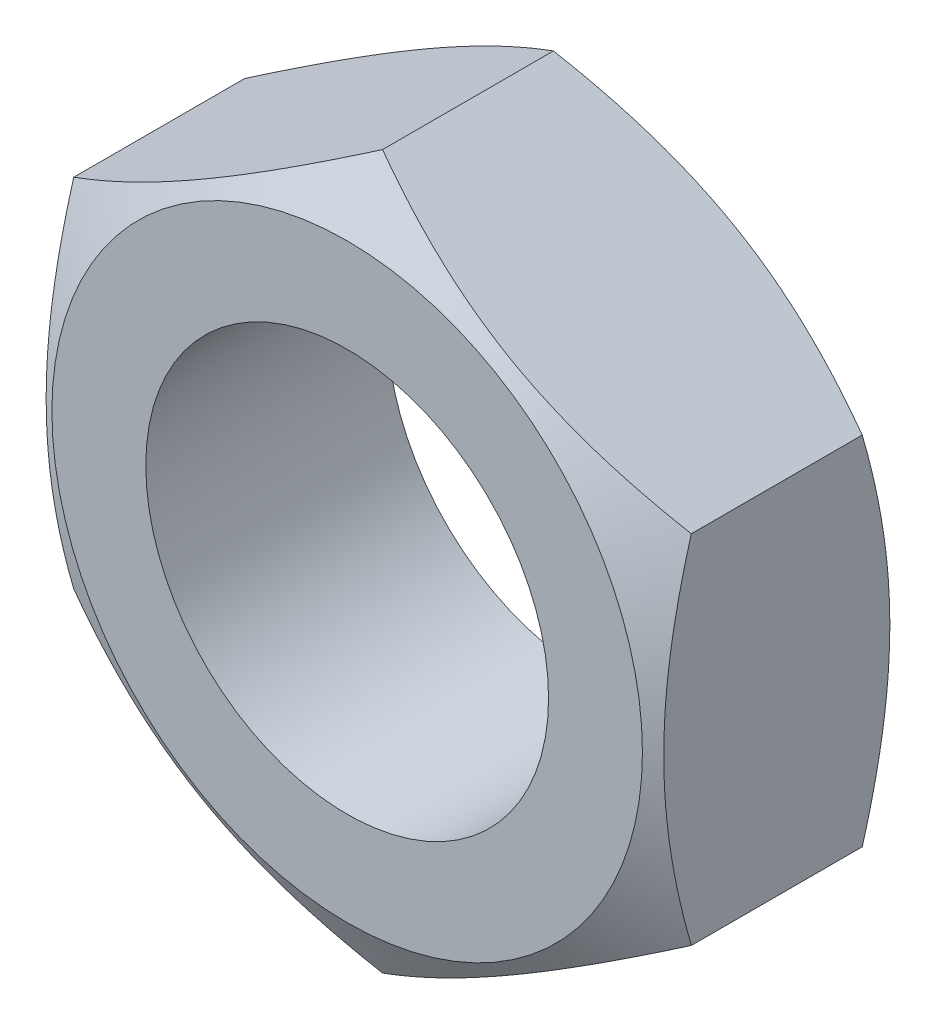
ISO-10303-21;
HEADER;
FILE_DESCRIPTION(('STEP AP214'),'2;1');
FILE_NAME('part.step','',(''),(''),'','','');
FILE_SCHEMA(('AUTOMOTIVE_DESIGN { 1 0 10303 214 1 1 1 1 }'));
ENDSEC;
DATA;
#1=APPLICATION_CONTEXT('core data for automotive mechanical design processes');
#2=APPLICATION_PROTOCOL_DEFINITION('international standard','automotive_design',2000,#1);
#3=PRODUCT_CONTEXT('',#1,'mechanical');
#4=PRODUCT('Part','Part','',(#3));
#5=PRODUCT_RELATED_PRODUCT_CATEGORY('part','',(#4));
#6=PRODUCT_DEFINITION_FORMATION('','',#4);
#7=PRODUCT_DEFINITION_CONTEXT('part definition',#1,'design');
#8=PRODUCT_DEFINITION('design','',#6,#7);
#9=PRODUCT_DEFINITION_SHAPE('','',#8);
#10=(LENGTH_UNIT() NAMED_UNIT(*) SI_UNIT(.MILLI.,.METRE.));
#11=(NAMED_UNIT(*) PLANE_ANGLE_UNIT() SI_UNIT($,.RADIAN.));
#12=(NAMED_UNIT(*) SI_UNIT($,.STERADIAN.) SOLID_ANGLE_UNIT());
#13=UNCERTAINTY_MEASURE_WITH_UNIT(LENGTH_MEASURE(1.E-05),#10,'distance_accuracy_value','');
#14=(GEOMETRIC_REPRESENTATION_CONTEXT(3) GLOBAL_UNCERTAINTY_ASSIGNED_CONTEXT((#13)) GLOBAL_UNIT_ASSIGNED_CONTEXT((#10,
#11,#12)) REPRESENTATION_CONTEXT('',''));
#15=CARTESIAN_POINT('',(0.,0.,0.));
#16=DIRECTION('',(0.,0.,1.));
#17=DIRECTION('',(1.,0.,0.));
#18=AXIS2_PLACEMENT_3D('',#15,#16,#17);
#19=CARTESIAN_POINT('',(0.,0.,0.));
#20=DIRECTION('',(0.,0.,1.));
#21=DIRECTION('',(0.,-1.,0.));
#22=AXIS2_PLACEMENT_3D('',#19,#20,#21);
#23=CONICAL_SURFACE('',#22,21.9924229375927,1.0471975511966);
#24=CARTESIAN_POINT('',(0.,0.,0.));
#25=DIRECTION('',(0.,0.,1.));
#26=DIRECTION('',(0.,-1.,0.));
#27=AXIS2_PLACEMENT_3D('',#24,#25,#26);
#28=CIRCLE('',#27,21.9924229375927);
#29=CARTESIAN_POINT('',(0.,-21.9924229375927,0.));
#30=VERTEX_POINT('',#29);
#31=EDGE_CURVE('E18',#30,#30,#28,.T.);
#32=ORIENTED_EDGE('',*,*,#31,.T.);
#33=EDGE_LOOP('',(#32));
#34=FACE_BOUND('',#33,.T.);
#35=CARTESIAN_POINT('',(-23.0001999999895,-13.2789407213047,2.63606869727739));
#36=CARTESIAN_POINT('',(-22.4946699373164,-13.5708086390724,2.46757088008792));
#37=CARTESIAN_POINT('',(-21.9871680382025,-13.86381499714,2.30671927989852));
#38=CARTESIAN_POINT('',(-20.968094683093,-14.4521772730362,2.00243388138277));
#39=CARTESIAN_POINT('',(-20.4565219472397,-14.7475339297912,1.859005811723));
#40=CARTESIAN_POINT('',(-19.4283073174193,-15.3411739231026,1.59149261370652));
#41=CARTESIAN_POINT('',(-18.9116563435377,-15.6394625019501,1.46745367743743));
#42=CARTESIAN_POINT('',(-17.8747863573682,-16.2380996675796,1.24139083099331));
#43=CARTESIAN_POINT('',(-17.354567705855,-16.5384480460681,1.13936472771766));
#44=CARTESIAN_POINT('',(-16.3238595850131,-17.133527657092,0.961658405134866));
#45=CARTESIAN_POINT('',(-15.8134465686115,-17.4282147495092,0.885390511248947));
#46=CARTESIAN_POINT('',(-14.7902817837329,-18.0189392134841,0.757506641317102));
#47=CARTESIAN_POINT('',(-14.2775299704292,-18.3149766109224,0.705891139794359));
#48=CARTESIAN_POINT('',(-13.2511650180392,-18.9075486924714,0.628615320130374));
#49=CARTESIAN_POINT('',(-12.7375536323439,-19.2040823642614,0.602924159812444));
#50=CARTESIAN_POINT('',(-11.7098568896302,-19.7974233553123,0.578049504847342));
#51=CARTESIAN_POINT('',(-11.1957715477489,-20.0942306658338,0.578865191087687));
#52=CARTESIAN_POINT('',(-10.2346805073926,-20.6491168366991,0.605152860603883));
#53=CARTESIAN_POINT('',(-9.78760635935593,-20.9072352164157,0.627419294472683));
#54=CARTESIAN_POINT('',(-8.89452539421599,-21.4228557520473,0.691576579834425));
#55=CARTESIAN_POINT('',(-8.4485185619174,-21.6803579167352,0.733467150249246));
#56=CARTESIAN_POINT('',(-7.55773701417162,-22.1946508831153,0.836146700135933));
#57=CARTESIAN_POINT('',(-7.11296378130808,-22.4514408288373,0.896952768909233));
#58=CARTESIAN_POINT('',(-6.22554696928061,-22.9637911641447,1.0363871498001));
#59=CARTESIAN_POINT('',(-5.78290338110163,-23.2193515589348,1.11501538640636));
#60=CARTESIAN_POINT('',(-4.43913170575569,-23.995178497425,1.37965122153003));
#61=CARTESIAN_POINT('',(-3.54182151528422,-24.5132407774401,1.59206038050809));
#62=CARTESIAN_POINT('',(-2.20576568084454,-25.2846129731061,1.95367700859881));
#63=CARTESIAN_POINT('',(-1.7624481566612,-25.5405624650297,2.08125290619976));
#64=CARTESIAN_POINT('',(-0.878879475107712,-26.050691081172,2.3493201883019));
#65=CARTESIAN_POINT('',(-0.438627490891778,-26.3048706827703,2.48980793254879));
#66=CARTESIAN_POINT('',(0.000200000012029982,-26.5582278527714,2.63606869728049));
#67=B_SPLINE_CURVE_WITH_KNOTS('',3,(#35,#36,#37,#38,#39,#40,#41,#42,#43,#44,#45,#46,#47,#48,#49,
#50,#51,#52,#53,#54,#55,#56,#57,#58,#59,#60,#61,#62,#63,#64,#65,#66),.UNSPECIFIED.,.F.,.F.,(4,2,
2,2,2,2,2,2,2,2,2,2,2,2,2,4),(0.,1.82275209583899,3.64610187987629,5.47373144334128,
7.30117883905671,9.08355891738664,10.8659733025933,12.6462646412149,14.4265009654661,
15.9762768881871,17.5260306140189,19.0771885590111,20.6283399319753,23.7989683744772,
25.3815208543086,26.9636285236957),.UNSPECIFIED.);
#68=CARTESIAN_POINT('',(-22.9999999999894,-13.2790561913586,2.63600203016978));
#69=VERTEX_POINT('',#68);
#70=CARTESIAN_POINT('',(1.20320420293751E-11,-26.5581123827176,2.63600203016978));
#71=VERTEX_POINT('',#70);
#72=EDGE_CURVE('E208',#69,#71,#67,.T.);
#73=ORIENTED_EDGE('',*,*,#72,.F.);
#74=CARTESIAN_POINT('',(-22.999999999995,35.137391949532,11.5488801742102));
#75=CARTESIAN_POINT('',(-22.9999999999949,34.6328085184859,11.3051417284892));
#76=CARTESIAN_POINT('',(-22.9999999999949,34.1276124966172,11.0626675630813));
#77=CARTESIAN_POINT('',(-22.9999999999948,33.1158666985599,10.5805463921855));
#78=CARTESIAN_POINT('',(-22.9999999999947,32.6093169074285,10.3408994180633));
#79=CARTESIAN_POINT('',(-22.9999999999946,31.5946593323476,9.86469588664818));
#80=CARTESIAN_POINT('',(-22.9999999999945,31.0865512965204,9.6281398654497));
#81=CARTESIAN_POINT('',(-22.9999999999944,30.0687263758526,9.15852083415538));
#82=CARTESIAN_POINT('',(-22.9999999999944,29.559009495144,8.92545781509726));
#83=CARTESIAN_POINT('',(-22.9999999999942,28.0213285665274,8.22942578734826));
#84=CARTESIAN_POINT('',(-22.9999999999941,26.990675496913,7.7723659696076));
#85=CARTESIAN_POINT('',(-22.9999999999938,24.920876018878,6.87798435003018));
#86=CARTESIAN_POINT('',(-22.9999999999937,23.8817300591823,6.44066151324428));
#87=CARTESIAN_POINT('',(-22.9999999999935,21.7807603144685,5.58598416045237));
#88=CARTESIAN_POINT('',(-22.9999999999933,20.7188138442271,5.16892959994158));
#89=CARTESIAN_POINT('',(-22.9999999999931,18.5823596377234,4.36768430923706));
#90=CARTESIAN_POINT('',(-22.999999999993,17.5078505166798,3.98349724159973));
#91=CARTESIAN_POINT('',(-22.9999999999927,15.3468305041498,3.25837418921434));
#92=CARTESIAN_POINT('',(-22.9999999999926,14.2603509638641,2.91734554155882));
#93=CARTESIAN_POINT('',(-22.9999999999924,12.0718448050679,2.28965048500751));
#94=CARTESIAN_POINT('',(-22.9999999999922,10.9698232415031,2.00296681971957));
#95=CARTESIAN_POINT('',(-22.999999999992,9.30491916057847,1.62423003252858));
#96=CARTESIAN_POINT('',(-22.999999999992,8.74783648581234,1.50651031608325));
#97=CARTESIAN_POINT('',(-22.9999999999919,7.62997982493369,1.29003650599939));
#98=CARTESIAN_POINT('',(-22.9999999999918,7.06920592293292,1.19128198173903));
#99=CARTESIAN_POINT('',(-22.9999999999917,5.94434909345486,1.01449389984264));
#100=CARTESIAN_POINT('',(-22.9999999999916,5.3802659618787,0.936461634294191));
#101=CARTESIAN_POINT('',(-22.9999999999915,4.24944349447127,0.802688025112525));
#102=CARTESIAN_POINT('',(-22.9999999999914,3.68270415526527,0.746946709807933));
#103=CARTESIAN_POINT('',(-22.9999999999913,2.55094652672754,0.659251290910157));
#104=CARTESIAN_POINT('',(-22.9999999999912,1.98593968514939,0.627150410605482));
#105=CARTESIAN_POINT('',(-22.9999999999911,0.855076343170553,0.586903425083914));
#106=CARTESIAN_POINT('',(-22.999999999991,0.28921985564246,0.578756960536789));
#107=CARTESIAN_POINT('',(-22.9999999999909,-0.842172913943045,0.586611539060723));
#108=CARTESIAN_POINT('',(-22.9999999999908,-1.40770924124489,0.602605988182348));
#109=CARTESIAN_POINT('',(-22.9999999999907,-2.5376141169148,0.658347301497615));
#110=CARTESIAN_POINT('',(-22.9999999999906,-3.10198261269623,0.69809521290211));
#111=CARTESIAN_POINT('',(-22.9999999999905,-4.47201591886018,0.822591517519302));
#112=CARTESIAN_POINT('',(-22.9999999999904,-5.27660599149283,0.919361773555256));
#113=CARTESIAN_POINT('',(-22.9999999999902,-6.87947044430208,1.15577839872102));
#114=CARTESIAN_POINT('',(-22.9999999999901,-7.67774385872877,1.29543119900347));
#115=CARTESIAN_POINT('',(-22.9999999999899,-9.26839888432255,1.61286098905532));
#116=CARTESIAN_POINT('',(-22.9999999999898,-10.0607640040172,1.7907198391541));
#117=CARTESIAN_POINT('',(-22.9999999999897,-11.6373562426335,2.17904286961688));
#118=CARTESIAN_POINT('',(-22.9999999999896,-12.4215836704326,2.38950580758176));
#119=CARTESIAN_POINT('',(-22.9999999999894,-14.0002566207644,2.84323429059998));
#120=CARTESIAN_POINT('',(-22.9999999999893,-14.7945138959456,3.08715038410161));
#121=CARTESIAN_POINT('',(-22.9999999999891,-16.3752474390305,3.5990952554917));
#122=CARTESIAN_POINT('',(-22.999999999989,-17.1617230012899,3.86712619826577));
#123=CARTESIAN_POINT('',(-22.9999999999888,-18.7231078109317,4.42164466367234));
#124=CARTESIAN_POINT('',(-22.9999999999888,-19.4980573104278,4.70801928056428));
#125=CARTESIAN_POINT('',(-22.9999999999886,-20.6556047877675,5.14989443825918));
#126=CARTESIAN_POINT('',(-22.9999999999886,-21.0405800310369,5.29921352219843));
#127=CARTESIAN_POINT('',(-22.9999999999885,-21.8090350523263,5.60162181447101));
#128=CARTESIAN_POINT('',(-22.9999999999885,-22.1925148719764,5.75471091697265));
#129=CARTESIAN_POINT('',(-22.9999999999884,-22.5753017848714,5.90951556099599));
#130=B_SPLINE_CURVE_WITH_KNOTS('',3,(#74,#75,#76,#77,#78,#79,#80,#81,#82,#83,#84,#85,#86,#87,
#88,#89,#90,#91,#92,#93,#94,#95,#96,#97,#98,#99,#100,#101,#102,#103,#104,#105,#106,#107,#108,
#109,#110,#111,#112,#113,#114,#115,#116,#117,#118,#119,#120,#121,#122,#123,#124,#125,#126,#127,
#128,#129),.UNSPECIFIED.,.F.,.F.,(4,2,2,2,2,2,2,2,2,2,2,2,2,2,2,2,2,2,2,2,2,2,2,2,2,2,2,4),(0.,
1.68110615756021,3.36223094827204,5.04364354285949,6.72505182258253,10.1072380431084,
13.4892467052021,16.911546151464,20.3342264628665,23.7494287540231,27.1635447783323,
28.8714282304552,30.5792728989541,32.28722403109,33.9951773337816,35.6924349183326,
37.3896670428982,39.08643566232,40.7832790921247,43.213090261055,45.6432660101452,
48.0787015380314,50.5140442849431,53.0061841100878,55.4985478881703,57.9768217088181,
59.2155628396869,60.4542692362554),.UNSPECIFIED.);
#131=CARTESIAN_POINT('',(-22.9999999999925,13.2790561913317,2.63600203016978));
#132=VERTEX_POINT('',#131);
#133=EDGE_CURVE('E90',#132,#69,#130,.T.);
#134=ORIENTED_EDGE('',*,*,#133,.F.);
#135=CARTESIAN_POINT('',(0.000199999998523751,26.5582278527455,2.63606869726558));
#136=CARTESIAN_POINT('',(-0.505330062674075,26.266359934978,2.4675708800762));
#137=CARTESIAN_POINT('',(-1.01283196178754,25.9733535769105,2.30671927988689));
#138=CARTESIAN_POINT('',(-2.03190531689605,25.3849913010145,2.00243388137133));
#139=CARTESIAN_POINT('',(-2.54347805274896,25.0896346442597,1.85900581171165));
#140=CARTESIAN_POINT('',(-3.57169268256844,24.4959946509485,1.59149261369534));
#141=CARTESIAN_POINT('',(-4.08834365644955,24.1977060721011,1.46745367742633));
#142=CARTESIAN_POINT('',(-5.12521364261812,23.5990689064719,1.24139083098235));
#143=CARTESIAN_POINT('',(-5.64543229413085,23.2987205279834,1.13936472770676));
#144=CARTESIAN_POINT('',(-6.67614041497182,22.7036409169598,0.961658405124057));
#145=CARTESIAN_POINT('',(-7.18655343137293,22.4089538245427,0.885390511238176));
#146=CARTESIAN_POINT('',(-8.20971821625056,21.8182293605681,0.75750664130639));
#147=CARTESIAN_POINT('',(-8.72247002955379,21.5221919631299,0.705891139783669));
#148=CARTESIAN_POINT('',(-9.74883498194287,20.9296198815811,0.628615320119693));
#149=CARTESIAN_POINT('',(-10.2624463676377,20.6330862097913,0.602924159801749));
#150=CARTESIAN_POINT('',(-11.2901431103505,20.0397452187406,0.578049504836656));
#151=CARTESIAN_POINT('',(-11.8042284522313,19.7429379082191,0.578865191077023));
#152=CARTESIAN_POINT('',(-12.7653194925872,19.1880517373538,0.605152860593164));
#153=CARTESIAN_POINT('',(-13.2123936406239,18.929933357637,0.627419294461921));
#154=CARTESIAN_POINT('',(-14.1054746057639,18.4143128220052,0.691576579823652));
#155=CARTESIAN_POINT('',(-14.5514814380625,18.1568106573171,0.733467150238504));
#156=CARTESIAN_POINT('',(-15.4422629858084,17.6425176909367,0.836146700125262));
#157=CARTESIAN_POINT('',(-15.8870362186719,17.3857277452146,0.896952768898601));
#158=CARTESIAN_POINT('',(-16.7744530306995,16.8733774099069,1.03638714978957));
#159=CARTESIAN_POINT('',(-17.2170966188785,16.6178170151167,1.11501538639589));
#160=CARTESIAN_POINT('',(-18.5608682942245,15.841990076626,1.37965122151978));
#161=CARTESIAN_POINT('',(-19.458178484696,15.3239277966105,1.59206038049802));
#162=CARTESIAN_POINT('',(-20.7942343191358,14.5525556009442,1.95367700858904));
#163=CARTESIAN_POINT('',(-21.2375518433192,14.2966061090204,2.08125290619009));
#164=CARTESIAN_POINT('',(-22.1211205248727,13.7864774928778,2.34932018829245));
#165=CARTESIAN_POINT('',(-22.5613725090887,13.5322978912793,2.48980793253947));
#166=CARTESIAN_POINT('',(-23.0001999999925,13.2789407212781,2.63606869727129));
#167=B_SPLINE_CURVE_WITH_KNOTS('',3,(#135,#136,#137,#138,#139,#140,#141,#142,#143,#144,#145,
#146,#147,#148,#149,#150,#151,#152,#153,#154,#155,#156,#157,#158,#159,#160,#161,#162,#163,#164,
#165,#166),.UNSPECIFIED.,.F.,.F.,(4,2,2,2,2,2,2,2,2,2,2,2,2,2,2,4),(0.,1.82275209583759,
3.64610187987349,5.47373144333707,7.30117883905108,9.08355891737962,10.8659733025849,
12.6462646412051,14.4265009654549,15.9762768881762,17.5260306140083,19.0771885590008,
20.6283399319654,23.798968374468,25.3815208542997,26.9636285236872),.UNSPECIFIED.);
#168=CARTESIAN_POINT('',(-1.47624967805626E-12,26.5581123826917,2.63600203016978));
#169=VERTEX_POINT('',#168);
#170=EDGE_CURVE('E82',#169,#132,#167,.T.);
#171=ORIENTED_EDGE('',*,*,#170,.F.);
#172=CARTESIAN_POINT('',(23.0001999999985,13.2789407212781,2.63606869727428));
#173=CARTESIAN_POINT('',(22.4946699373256,13.5708086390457,2.46757088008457));
#174=CARTESIAN_POINT('',(21.9871680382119,13.8638149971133,2.30671927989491));
#175=CARTESIAN_POINT('',(20.9680946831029,14.4521772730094,2.00243388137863));
#176=CARTESIAN_POINT('',(20.4565219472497,14.7475339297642,1.8590058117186));
#177=CARTESIAN_POINT('',(19.4283073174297,15.3411739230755,1.59149261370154));
#178=CARTESIAN_POINT('',(18.9116563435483,15.6394625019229,1.46745367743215));
#179=CARTESIAN_POINT('',(17.8747863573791,16.2380996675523,1.24139083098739));
#180=CARTESIAN_POINT('',(17.3545677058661,16.5384480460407,1.13936472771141));
#181=CARTESIAN_POINT('',(16.3238595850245,17.1335276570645,0.961658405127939));
#182=CARTESIAN_POINT('',(15.8134465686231,17.4282147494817,0.88539051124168));
#183=CARTESIAN_POINT('',(14.7902817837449,18.0189392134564,0.757506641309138));
#184=CARTESIAN_POINT('',(14.2775299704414,18.3149766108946,0.705891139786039));
#185=CARTESIAN_POINT('',(13.2511650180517,18.9075486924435,0.62861532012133));
#186=CARTESIAN_POINT('',(12.7375536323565,19.2040823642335,0.602924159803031));
#187=CARTESIAN_POINT('',(11.7098568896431,19.7974233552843,0.578049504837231));
#188=CARTESIAN_POINT('',(11.1957715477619,20.0942306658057,0.578865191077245));
#189=CARTESIAN_POINT('',(10.2346805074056,20.6491168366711,0.605152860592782));
#190=CARTESIAN_POINT('',(9.78760635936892,20.9072352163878,0.627419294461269));
#191=CARTESIAN_POINT('',(8.89452539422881,21.4228557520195,0.691576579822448));
#192=CARTESIAN_POINT('',(8.44851856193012,21.6803579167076,0.733467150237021));
#193=CARTESIAN_POINT('',(7.55773701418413,22.1946508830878,0.836146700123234));
#194=CARTESIAN_POINT('',(7.11296378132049,22.4514408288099,0.896952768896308));
#195=CARTESIAN_POINT('',(6.22554696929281,22.9637911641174,1.03638714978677));
#196=CARTESIAN_POINT('',(5.78290338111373,23.2193515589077,1.11501538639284));
#197=CARTESIAN_POINT('',(4.43913170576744,23.9951784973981,1.37965122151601));
#198=CARTESIAN_POINT('',(3.54182151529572,24.5132407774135,1.59206038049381));
#199=CARTESIAN_POINT('',(2.20576568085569,25.2846129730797,1.95367700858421));
#200=CARTESIAN_POINT('',(1.76244815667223,25.5405624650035,2.08125290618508));
#201=CARTESIAN_POINT('',(0.878879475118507,26.050691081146,2.34932018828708));
#202=CARTESIAN_POINT('',(0.438627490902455,26.3048706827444,2.48980793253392));
#203=CARTESIAN_POINT('',(-0.000200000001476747,26.5582278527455,2.63606869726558));
#204=B_SPLINE_CURVE_WITH_KNOTS('',3,(#172,#173,#174,#175,#176,#177,#178,#179,#180,#181,#182,
#183,#184,#185,#186,#187,#188,#189,#190,#191,#192,#193,#194,#195,#196,#197,#198,#199,#200,#201,
#202,#203),.UNSPECIFIED.,.F.,.F.,(4,2,2,2,2,2,2,2,2,2,2,2,2,2,2,4),(0.,1.8227520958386,
3.6461018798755,5.47373144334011,7.30117883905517,9.08355891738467,10.865973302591,
12.6462646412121,14.4265009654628,15.9762768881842,17.5260306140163,19.0771885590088,
20.6283399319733,23.798968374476,25.3815208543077,26.9636285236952),.UNSPECIFIED.);
#205=CARTESIAN_POINT('',(22.9999999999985,13.279056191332,2.63600203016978));
#206=VERTEX_POINT('',#205);
#207=EDGE_CURVE('E67',#206,#169,#204,.T.);
#208=ORIENTED_EDGE('',*,*,#207,.F.);
#209=CARTESIAN_POINT('',(22.999999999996,35.1373919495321,11.5488801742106));
#210=CARTESIAN_POINT('',(22.999999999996,34.6328085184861,11.3051417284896));
#211=CARTESIAN_POINT('',(22.9999999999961,34.1276124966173,11.0626675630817));
#212=CARTESIAN_POINT('',(22.9999999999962,33.1158666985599,10.580546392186));
#213=CARTESIAN_POINT('',(22.9999999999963,32.6093169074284,10.3408994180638));
#214=CARTESIAN_POINT('',(22.9999999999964,31.5946593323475,9.86469588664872));
#215=CARTESIAN_POINT('',(22.9999999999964,31.0865512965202,9.62813986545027));
#216=CARTESIAN_POINT('',(22.9999999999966,30.0687263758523,9.158520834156));
#217=CARTESIAN_POINT('',(22.9999999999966,29.5590094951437,8.92545781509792));
#218=CARTESIAN_POINT('',(22.9999999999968,28.021328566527,8.22942578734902));
#219=CARTESIAN_POINT('',(22.9999999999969,26.9906754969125,7.77236596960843));
#220=CARTESIAN_POINT('',(22.9999999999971,24.9208760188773,6.87798435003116));
#221=CARTESIAN_POINT('',(22.9999999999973,23.8817300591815,6.44066151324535));
#222=CARTESIAN_POINT('',(22.9999999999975,21.7807603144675,5.58598416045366));
#223=CARTESIAN_POINT('',(22.9999999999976,20.718813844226,5.168929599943));
#224=CARTESIAN_POINT('',(22.9999999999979,18.5823596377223,4.36768430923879));
#225=CARTESIAN_POINT('',(22.999999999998,17.5078505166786,3.98349724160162));
#226=CARTESIAN_POINT('',(22.9999999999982,15.3468305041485,3.25837418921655));
#227=CARTESIAN_POINT('',(22.9999999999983,14.2603509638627,2.9173455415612));
#228=CARTESIAN_POINT('',(22.9999999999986,12.0718448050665,2.28965048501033));
#229=CARTESIAN_POINT('',(22.9999999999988,10.9698232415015,2.00296681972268));
#230=CARTESIAN_POINT('',(22.999999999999,9.30491916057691,1.62423003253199));
#231=CARTESIAN_POINT('',(22.999999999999,8.74783648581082,1.50651031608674));
#232=CARTESIAN_POINT('',(22.9999999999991,7.62997982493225,1.29003650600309));
#233=CARTESIAN_POINT('',(22.9999999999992,7.06920592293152,1.19128198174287));
#234=CARTESIAN_POINT('',(22.9999999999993,5.94434909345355,1.01449389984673));
#235=CARTESIAN_POINT('',(22.9999999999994,5.38026596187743,0.936461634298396));
#236=CARTESIAN_POINT('',(22.9999999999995,4.2494434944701,0.802688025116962));
#237=CARTESIAN_POINT('',(22.9999999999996,3.68270415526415,0.746946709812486));
#238=CARTESIAN_POINT('',(22.9999999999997,2.55094652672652,0.659251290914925));
#239=CARTESIAN_POINT('',(22.9999999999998,1.98593968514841,0.627150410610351));
#240=CARTESIAN_POINT('',(22.9999999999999,0.855076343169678,0.586903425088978));
#241=CARTESIAN_POINT('',(23.,0.289219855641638,0.578756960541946));
#242=CARTESIAN_POINT('',(23.0000000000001,-0.842172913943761,0.586611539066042));
#243=CARTESIAN_POINT('',(23.0000000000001,-1.40770924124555,0.602605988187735));
#244=CARTESIAN_POINT('',(23.0000000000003,-2.53761411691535,0.658347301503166));
#245=CARTESIAN_POINT('',(23.0000000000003,-3.10198261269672,0.698095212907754));
#246=CARTESIAN_POINT('',(23.0000000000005,-4.47201591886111,0.822591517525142));
#247=CARTESIAN_POINT('',(23.0000000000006,-5.27660599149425,0.919361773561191));
#248=CARTESIAN_POINT('',(23.0000000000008,-6.87947044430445,1.15577839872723));
#249=CARTESIAN_POINT('',(23.0000000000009,-7.67774385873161,1.29543119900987));
#250=CARTESIAN_POINT('',(23.000000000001,-9.26839888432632,1.61286098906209));
#251=CARTESIAN_POINT('',(23.0000000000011,-10.0607640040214,1.79071983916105));
#252=CARTESIAN_POINT('',(23.0000000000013,-11.6373562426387,2.17904286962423));
#253=CARTESIAN_POINT('',(23.0000000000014,-12.4215836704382,2.38950580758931));
#254=CARTESIAN_POINT('',(23.0000000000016,-14.0002566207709,2.84323429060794));
#255=CARTESIAN_POINT('',(23.0000000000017,-14.7945138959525,3.08715038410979));
#256=CARTESIAN_POINT('',(23.0000000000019,-16.3752474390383,3.59909525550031));
#257=CARTESIAN_POINT('',(23.0000000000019,-17.1617230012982,3.86712619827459));
#258=CARTESIAN_POINT('',(23.0000000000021,-18.7231078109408,4.4216446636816));
#259=CARTESIAN_POINT('',(23.0000000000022,-19.4980573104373,4.70801928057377));
#260=CARTESIAN_POINT('',(23.0000000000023,-20.6556047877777,5.149894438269));
#261=CARTESIAN_POINT('',(23.0000000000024,-21.0405800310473,5.29921352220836));
#262=CARTESIAN_POINT('',(23.0000000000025,-21.8090350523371,5.60162181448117));
#263=CARTESIAN_POINT('',(23.0000000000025,-22.1925148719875,5.75471091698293));
#264=CARTESIAN_POINT('',(23.0000000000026,-22.5753017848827,5.9095155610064));
#265=B_SPLINE_CURVE_WITH_KNOTS('',3,(#209,#210,#211,#212,#213,#214,#215,#216,#217,#218,#219,
#220,#221,#222,#223,#224,#225,#226,#227,#228,#229,#230,#231,#232,#233,#234,#235,#236,#237,#238,
#239,#240,#241,#242,#243,#244,#245,#246,#247,#248,#249,#250,#251,#252,#253,#254,#255,#256,#257,
#258,#259,#260,#261,#262,#263,#264),.UNSPECIFIED.,.F.,.F.,(4,2,2,2,2,2,2,2,2,2,2,2,2,2,2,2,2,2,
2,2,2,2,2,2,2,2,2,4),(0.,1.68110615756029,3.36223094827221,5.04364354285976,6.72505182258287,
10.1072380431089,13.4892467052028,16.9115461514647,20.3342264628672,23.7494287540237,
27.1635447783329,28.8714282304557,30.5792728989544,32.2872240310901,33.9951773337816,
35.6924349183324,37.3896670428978,39.0864356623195,40.783279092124,43.2130902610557,
45.6432660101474,48.0787015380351,50.5140442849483,53.0061841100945,55.4985478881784,
57.9768217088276,59.2155628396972,60.4542692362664),.UNSPECIFIED.);
#266=CARTESIAN_POINT('',(23.0000000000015,-13.2790561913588,2.63600203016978));
#267=VERTEX_POINT('',#266);
#268=EDGE_CURVE('E182',#267,#206,#265,.F.);
#269=ORIENTED_EDGE('',*,*,#268,.F.);
#270=CARTESIAN_POINT('',(-0.000199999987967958,-26.5582278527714,2.63606869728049));
#271=CARTESIAN_POINT('',(0.505330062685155,-26.2663599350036,2.46757088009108));
#272=CARTESIAN_POINT('',(1.01283196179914,-25.9733535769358,2.30671927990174));
#273=CARTESIAN_POINT('',(2.03190531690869,-25.3849913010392,2.00243388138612));
#274=CARTESIAN_POINT('',(2.54347805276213,-25.089634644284,1.85900581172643));
#275=CARTESIAN_POINT('',(3.57169268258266,-24.4959946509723,1.59149261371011));
#276=CARTESIAN_POINT('',(4.08834365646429,-24.1977060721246,1.46745367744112));
#277=CARTESIAN_POINT('',(5.12521364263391,-23.5990689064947,1.24139083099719));
#278=CARTESIAN_POINT('',(5.64543229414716,-23.298720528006,1.13936472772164));
#279=CARTESIAN_POINT('',(6.67614041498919,-22.7036409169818,0.961658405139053));
#280=CARTESIAN_POINT('',(7.18655343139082,-22.4089538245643,0.885390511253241));
#281=CARTESIAN_POINT('',(8.2097182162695,-21.8182293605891,0.75750664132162));
#282=CARTESIAN_POINT('',(8.72247002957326,-21.5221919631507,0.705891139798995));
#283=CARTESIAN_POINT('',(9.74883498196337,-20.9296198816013,0.628615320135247));
#284=CARTESIAN_POINT('',(10.2624463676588,-20.6330862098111,0.602924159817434));
#285=CARTESIAN_POINT('',(11.2901431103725,-20.0397452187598,0.578049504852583));
#286=CARTESIAN_POINT('',(11.8042284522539,-19.7429379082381,0.57886519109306));
#287=CARTESIAN_POINT('',(12.7653194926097,-19.1880517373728,0.605152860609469));
#288=CARTESIAN_POINT('',(13.2123936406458,-18.9299333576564,0.627419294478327));
#289=CARTESIAN_POINT('',(14.1054746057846,-18.4143128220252,0.69157657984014));
#290=CARTESIAN_POINT('',(14.5514814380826,-18.1568106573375,0.733467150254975));
#291=CARTESIAN_POINT('',(15.4422629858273,-17.6425176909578,0.836146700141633));
#292=CARTESIAN_POINT('',(15.8870362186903,-17.385727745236,0.896952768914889));
#293=CARTESIAN_POINT('',(16.7744530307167,-16.873377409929,1.03638714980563));
#294=CARTESIAN_POINT('',(17.2170966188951,-16.6178170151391,1.1150153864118));
#295=CARTESIAN_POINT('',(18.5608682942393,-15.8419900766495,1.37965122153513));
#296=CARTESIAN_POINT('',(19.4581784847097,-15.3239277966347,1.59206038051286));
#297=CARTESIAN_POINT('',(20.7942343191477,-14.5525556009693,1.95367700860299));
#298=CARTESIAN_POINT('',(21.2375518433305,-14.2966061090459,2.08125290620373));
#299=CARTESIAN_POINT('',(22.1211205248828,-13.7864774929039,2.34932018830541));
#300=CARTESIAN_POINT('',(22.5613725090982,-13.5322978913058,2.48980793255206));
#301=CARTESIAN_POINT('',(23.0002000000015,-13.2789407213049,2.63606869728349));
#302=B_SPLINE_CURVE_WITH_KNOTS('',3,(#270,#271,#272,#273,#274,#275,#276,#277,#278,#279,#280,
#281,#282,#283,#284,#285,#286,#287,#288,#289,#290,#291,#292,#293,#294,#295,#296,#297,#298,#299,
#300,#301),.UNSPECIFIED.,.F.,.F.,(4,2,2,2,2,2,2,2,2,2,2,2,2,2,2,4),(0.,1.82275209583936,
3.64610187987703,5.47373144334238,7.30117883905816,9.08355891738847,10.8659733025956,
12.6462646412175,14.4265009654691,15.9762768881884,17.5260306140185,19.0771885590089,
20.6283399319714,23.7989683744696,25.3815208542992,26.9636285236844),.UNSPECIFIED.);
#303=EDGE_CURVE('E201',#71,#267,#302,.T.);
#304=ORIENTED_EDGE('',*,*,#303,.F.);
#305=EDGE_LOOP('',(#73,#134,#171,#208,#269,#304));
#306=FACE_BOUND('',#305,.T.);
#307=ADVANCED_FACE('F14',(#34,#306),#23,.T.);
#308=CARTESIAN_POINT('',(7.5000000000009,0.,0.));
#309=DIRECTION('',(0.,0.,1.));
#310=DIRECTION('',(0.,-1.,0.));
#311=AXIS2_PLACEMENT_3D('',#308,#309,#310);
#312=PLANE('',#311);
#313=CARTESIAN_POINT('',(0.,0.,0.));
#314=DIRECTION('',(0.,0.,1.));
#315=DIRECTION('',(1.,0.,0.));
#316=AXIS2_PLACEMENT_3D('',#313,#314,#315);
#317=CIRCLE('',#316,15.);
#318=CARTESIAN_POINT('',(15.,0.,0.));
#319=VERTEX_POINT('',#318);
#320=EDGE_CURVE('E222',#319,#319,#317,.T.);
#321=ORIENTED_EDGE('',*,*,#320,.T.);
#322=EDGE_LOOP('',(#321));
#323=FACE_BOUND('',#322,.T.);
#324=ORIENTED_EDGE('',*,*,#31,.F.);
#325=EDGE_LOOP('',(#324));
#326=FACE_BOUND('',#325,.T.);
#327=ADVANCED_FACE('F246',(#323,#326),#312,.F.);
#328=CARTESIAN_POINT('',(-22.9999999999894,-13.2790561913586,-70.2661606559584));
#329=DIRECTION('',(-0.499999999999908,-0.866025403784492,0.));
#330=DIRECTION('',(0.866025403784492,-0.499999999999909,0.));
#331=AXIS2_PLACEMENT_3D('',#328,#329,#330);
#332=PLANE('',#331);
#333=ORIENTED_EDGE('',*,*,#72,.T.);
#334=DIRECTION('',(0.,0.,1.));
#335=VECTOR('',#334,1.);
#336=CARTESIAN_POINT('',(1.20320420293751E-11,-26.5581123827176,-70.2661606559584));
#337=LINE('',#336,#335);
#338=CARTESIAN_POINT('',(1.20320420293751E-11,-26.5581123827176,15.3639979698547));
#339=VERTEX_POINT('',#338);
#340=EDGE_CURVE('E206',#71,#339,#337,.T.);
#341=ORIENTED_EDGE('',*,*,#340,.T.);
#342=CARTESIAN_POINT('',(0.000200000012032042,-26.5582278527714,15.3639313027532));
#343=CARTESIAN_POINT('',(-0.505330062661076,-26.2663599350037,15.5324291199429));
#344=CARTESIAN_POINT('',(-1.01283196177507,-25.973353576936,15.6932807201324));
#345=CARTESIAN_POINT('',(-2.03190531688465,-25.3849913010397,15.9975661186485));
#346=CARTESIAN_POINT('',(-2.5434780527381,-25.0896346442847,16.1409941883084));
#347=CARTESIAN_POINT('',(-3.57169268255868,-24.4959946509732,16.4085073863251));
#348=CARTESIAN_POINT('',(-4.08834365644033,-24.1977060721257,16.5325463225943));
#349=CARTESIAN_POINT('',(-5.12521364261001,-23.5990689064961,16.7586091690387));
#350=CARTESIAN_POINT('',(-5.64543229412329,-23.2987205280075,16.8606352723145));
#351=CARTESIAN_POINT('',(-6.67614041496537,-22.7036409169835,17.0383415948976));
#352=CARTESIAN_POINT('',(-7.18655343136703,-22.4089538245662,17.1146094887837));
#353=CARTESIAN_POINT('',(-8.20971821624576,-21.8182293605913,17.2424933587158));
#354=CARTESIAN_POINT('',(-8.72247002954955,-21.522191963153,17.2941088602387));
#355=CARTESIAN_POINT('',(-9.74883498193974,-20.9296198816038,17.371384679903));
#356=CARTESIAN_POINT('',(-10.2624463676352,-20.6330862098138,17.397075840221));
#357=CARTESIAN_POINT('',(-11.2901431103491,-20.0397452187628,17.4219504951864));
#358=CARTESIAN_POINT('',(-11.8042284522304,-19.7429379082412,17.4211348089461));
#359=CARTESIAN_POINT('',(-12.7653194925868,-19.1880517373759,17.3948471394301));
#360=CARTESIAN_POINT('',(-13.2123936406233,-18.9299333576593,17.3725807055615));
#361=CARTESIAN_POINT('',(-14.1054746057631,-18.4143128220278,17.3084234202));
#362=CARTESIAN_POINT('',(-14.5514814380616,-18.15681065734,17.2665328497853));
#363=CARTESIAN_POINT('',(-15.4422629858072,-17.64251769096,17.1638532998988));
#364=CARTESIAN_POINT('',(-15.8870362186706,-17.385727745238,17.1030472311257));
#365=CARTESIAN_POINT('',(-16.7744530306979,-16.8733774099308,16.963612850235));
#366=CARTESIAN_POINT('',(-17.2170966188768,-16.6178170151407,16.8849846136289));
#367=CARTESIAN_POINT('',(-18.5608682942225,-15.8419900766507,16.6203487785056));
#368=CARTESIAN_POINT('',(-19.4581784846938,-15.3239277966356,16.4079396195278));
#369=CARTESIAN_POINT('',(-20.7942343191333,-14.5525556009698,16.0463229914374));
#370=CARTESIAN_POINT('',(-21.2375518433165,-14.2966061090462,15.9187470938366));
#371=CARTESIAN_POINT('',(-22.1211205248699,-13.786477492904,15.6506798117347));
#372=CARTESIAN_POINT('',(-22.5613725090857,-13.5322978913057,15.5101920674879));
#373=CARTESIAN_POINT('',(-23.0001999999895,-13.2789407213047,15.3639313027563));
#374=B_SPLINE_CURVE_WITH_KNOTS('',3,(#342,#343,#344,#345,#346,#347,#348,#349,#350,#351,#352,
#353,#354,#355,#356,#357,#358,#359,#360,#361,#362,#363,#364,#365,#366,#367,#368,#369,#370,#371,
#372,#373),.UNSPECIFIED.,.F.,.F.,(4,2,2,2,2,2,2,2,2,2,2,2,2,2,2,4),(0.,1.82275209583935,
3.64610187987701,5.47373144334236,7.30117883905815,9.08355891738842,10.8659733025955,
12.6462646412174,14.4265009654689,15.9762768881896,17.526030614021,19.0771885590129,
20.6283399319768,23.7989683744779,25.3815208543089,26.9636285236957),.UNSPECIFIED.);
#375=CARTESIAN_POINT('',(-22.9999999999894,-13.279056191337,15.363997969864));
#376=VERTEX_POINT('',#375);
#377=EDGE_CURVE('E158',#339,#376,#374,.T.);
#378=ORIENTED_EDGE('',*,*,#377,.T.);
#379=DIRECTION('',(0.,0.,1.));
#380=VECTOR('',#379,1.);
#381=CARTESIAN_POINT('',(-22.9999999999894,-13.2790561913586,-70.2661606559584));
#382=LINE('',#381,#380);
#383=EDGE_CURVE('E209',#69,#376,#382,.T.);
#384=ORIENTED_EDGE('',*,*,#383,.F.);
#385=EDGE_LOOP('',(#333,#341,#378,#384));
#386=FACE_BOUND('',#385,.T.);
#387=ADVANCED_FACE('F122',(#386),#332,.T.);
#388=CARTESIAN_POINT('',(1.20320420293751E-11,-26.5581123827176,-70.2661606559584));
#389=DIRECTION('',(0.500000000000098,-0.866025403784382,0.));
#390=DIRECTION('',(0.866025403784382,0.500000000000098,0.));
#391=AXIS2_PLACEMENT_3D('',#388,#389,#390);
#392=PLANE('',#391);
#393=ORIENTED_EDGE('',*,*,#303,.T.);
#394=DIRECTION('',(0.,0.,1.));
#395=VECTOR('',#394,1.);
#396=CARTESIAN_POINT('',(23.0000000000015,-13.2790561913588,-70.2661606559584));
#397=LINE('',#396,#395);
#398=CARTESIAN_POINT('',(23.0000000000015,-13.2790561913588,15.3639979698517));
#399=VERTEX_POINT('',#398);
#400=EDGE_CURVE('E193',#267,#399,#397,.T.);
#401=ORIENTED_EDGE('',*,*,#400,.T.);
#402=CARTESIAN_POINT('',(23.0002000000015,-13.2789407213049,15.3639313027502));
#403=CARTESIAN_POINT('',(22.4946699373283,-13.5708086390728,15.5324291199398));
#404=CARTESIAN_POINT('',(21.9871680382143,-13.8638149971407,15.6932807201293));
#405=CARTESIAN_POINT('',(20.9680946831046,-14.4521772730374,15.9975661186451));
#406=CARTESIAN_POINT('',(20.4565219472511,-14.7475339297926,16.140994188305));
#407=CARTESIAN_POINT('',(19.4283073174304,-15.3411739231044,16.4085073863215));
#408=CARTESIAN_POINT('',(18.9116563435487,-15.6394625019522,16.5325463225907));
#409=CARTESIAN_POINT('',(17.8747863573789,-16.2380996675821,16.7586091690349));
#410=CARTESIAN_POINT('',(17.3545677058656,-16.5384480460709,16.8606352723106));
#411=CARTESIAN_POINT('',(16.3238595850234,-17.1335276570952,17.0383415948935));
#412=CARTESIAN_POINT('',(15.8134465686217,-17.4282147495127,17.1146094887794));
#413=CARTESIAN_POINT('',(14.7902817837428,-18.018939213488,17.2424933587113));
#414=CARTESIAN_POINT('',(14.277529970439,-18.3149766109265,17.2941088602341));
#415=CARTESIAN_POINT('',(13.2511650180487,-18.907548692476,17.3713846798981));
#416=CARTESIAN_POINT('',(12.7375536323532,-19.2040823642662,17.3970758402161));
#417=CARTESIAN_POINT('',(11.7098568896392,-19.7974233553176,17.4219504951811));
#418=CARTESIAN_POINT('',(11.1957715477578,-20.0942306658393,17.4211348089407));
#419=CARTESIAN_POINT('',(10.234680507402,-20.6491168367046,17.3948471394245));
#420=CARTESIAN_POINT('',(9.78760635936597,-20.907235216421,17.3725807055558));
#421=CARTESIAN_POINT('',(8.89452539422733,-21.4228557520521,17.3084234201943));
#422=CARTESIAN_POINT('',(8.44851856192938,-21.6803579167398,17.2665328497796));
#423=CARTESIAN_POINT('',(7.55773701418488,-22.1946508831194,17.1638532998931));
#424=CARTESIAN_POINT('',(7.11296378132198,-22.4514408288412,17.10304723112));
#425=CARTESIAN_POINT('',(6.22554696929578,-22.963791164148,16.9636128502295));
#426=CARTESIAN_POINT('',(5.78290338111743,-23.2193515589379,16.8849846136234));
#427=CARTESIAN_POINT('',(4.43913170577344,-23.9951784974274,16.6203487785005));
#428=CARTESIAN_POINT('',(3.54182151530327,-24.5132407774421,16.407939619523));
#429=CARTESIAN_POINT('',(2.20576568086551,-25.2846129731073,16.0463229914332));
#430=CARTESIAN_POINT('',(1.76244815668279,-25.5405624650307,15.9187470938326));
#431=CARTESIAN_POINT('',(0.878879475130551,-26.0506910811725,15.6506798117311));
#432=CARTESIAN_POINT('',(0.438627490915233,-26.3048706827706,15.5101920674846));
#433=CARTESIAN_POINT('',(-0.000199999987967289,-26.5582278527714,15.3639313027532));
#434=B_SPLINE_CURVE_WITH_KNOTS('',3,(#402,#403,#404,#405,#406,#407,#408,#409,#410,#411,#412,
#413,#414,#415,#416,#417,#418,#419,#420,#421,#422,#423,#424,#425,#426,#427,#428,#429,#430,#431,
#432,#433),.UNSPECIFIED.,.F.,.F.,(4,2,2,2,2,2,2,2,2,2,2,2,2,2,2,4),(0.,1.82275209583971,
3.64610187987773,5.47373144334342,7.30117883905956,9.0835589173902,10.8659733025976,
12.6462646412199,14.4265009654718,15.9762768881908,17.5260306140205,19.0771885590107,
20.6283399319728,23.7989683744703,25.3815208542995,26.9636285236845),.UNSPECIFIED.);
#435=EDGE_CURVE('E165',#399,#339,#434,.T.);
#436=ORIENTED_EDGE('',*,*,#435,.T.);
#437=ORIENTED_EDGE('',*,*,#340,.F.);
#438=EDGE_LOOP('',(#393,#401,#436,#437));
#439=FACE_BOUND('',#438,.T.);
#440=ADVANCED_FACE('F178',(#439),#392,.T.);
#441=CARTESIAN_POINT('',(23.0000000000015,-13.2790561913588,-70.2661606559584));
#442=DIRECTION('',(1.,1.13914637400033E-13,0.));
#443=DIRECTION('',(-1.13914637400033E-13,1.,0.));
#444=AXIS2_PLACEMENT_3D('',#441,#442,#443);
#445=PLANE('',#444);
#446=ORIENTED_EDGE('',*,*,#268,.T.);
#447=DIRECTION('',(0.,0.,1.));
#448=VECTOR('',#447,1.);
#449=CARTESIAN_POINT('',(22.9999999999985,13.279056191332,-70.2661606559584));
#450=LINE('',#449,#448);
#451=CARTESIAN_POINT('',(22.9999999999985,13.279056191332,15.3639979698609));
#452=VERTEX_POINT('',#451);
#453=EDGE_CURVE('E73',#206,#452,#450,.T.);
#454=ORIENTED_EDGE('',*,*,#453,.T.);
#455=CARTESIAN_POINT('',(22.999999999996,35.1373919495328,6.45111982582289));
#456=CARTESIAN_POINT('',(22.999999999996,34.6328085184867,6.69485827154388));
#457=CARTESIAN_POINT('',(22.9999999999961,34.1276124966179,6.93733243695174));
#458=CARTESIAN_POINT('',(22.9999999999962,33.1158666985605,7.41945360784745));
#459=CARTESIAN_POINT('',(22.9999999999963,32.609316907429,7.65910058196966));
#460=CARTESIAN_POINT('',(22.9999999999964,31.5946593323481,8.13530411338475));
#461=CARTESIAN_POINT('',(22.9999999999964,31.0865512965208,8.3718601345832));
#462=CARTESIAN_POINT('',(22.9999999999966,30.0687263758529,8.84147916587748));
#463=CARTESIAN_POINT('',(22.9999999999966,29.5590094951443,9.07454218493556));
#464=CARTESIAN_POINT('',(22.9999999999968,28.0213285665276,9.77057421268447));
#465=CARTESIAN_POINT('',(22.9999999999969,26.9906754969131,10.2276340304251));
#466=CARTESIAN_POINT('',(22.9999999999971,24.9208760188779,11.1220156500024));
#467=CARTESIAN_POINT('',(22.9999999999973,23.8817300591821,11.5593384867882));
#468=CARTESIAN_POINT('',(22.9999999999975,21.7807603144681,12.4140158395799));
#469=CARTESIAN_POINT('',(22.9999999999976,20.7188138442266,12.8310704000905));
#470=CARTESIAN_POINT('',(22.9999999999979,18.5823596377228,13.6323156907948));
#471=CARTESIAN_POINT('',(22.999999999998,17.5078505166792,14.016502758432));
#472=CARTESIAN_POINT('',(22.9999999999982,15.346830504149,14.741625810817));
#473=CARTESIAN_POINT('',(22.9999999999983,14.2603509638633,15.0826544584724));
#474=CARTESIAN_POINT('',(22.9999999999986,12.071844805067,15.7103495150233));
#475=CARTESIAN_POINT('',(22.9999999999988,10.9698232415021,15.997033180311));
#476=CARTESIAN_POINT('',(22.999999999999,9.30491916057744,16.3757699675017));
#477=CARTESIAN_POINT('',(22.999999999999,8.74783648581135,16.4934896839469));
#478=CARTESIAN_POINT('',(22.9999999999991,7.62997982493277,16.7099634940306));
#479=CARTESIAN_POINT('',(22.9999999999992,7.06920592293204,16.8087180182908));
#480=CARTESIAN_POINT('',(22.9999999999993,5.94434909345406,16.985506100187));
#481=CARTESIAN_POINT('',(22.9999999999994,5.38026596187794,17.0635383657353));
#482=CARTESIAN_POINT('',(22.9999999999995,4.2494434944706,17.1973119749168));
#483=CARTESIAN_POINT('',(22.9999999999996,3.68270415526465,17.2530532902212));
#484=CARTESIAN_POINT('',(22.9999999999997,2.55094652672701,17.3407487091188));
#485=CARTESIAN_POINT('',(22.9999999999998,1.9859396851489,17.3728495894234));
#486=CARTESIAN_POINT('',(22.9999999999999,0.855076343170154,17.4130965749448));
#487=CARTESIAN_POINT('',(23.,0.289219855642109,17.4212430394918));
#488=CARTESIAN_POINT('',(23.0000000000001,-0.842172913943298,17.4133884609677));
#489=CARTESIAN_POINT('',(23.0000000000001,-1.40770924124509,17.3973940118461));
#490=CARTESIAN_POINT('',(23.0000000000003,-2.5376141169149,17.3416526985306));
#491=CARTESIAN_POINT('',(23.0000000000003,-3.10198261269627,17.301904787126));
#492=CARTESIAN_POINT('',(23.0000000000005,-4.47201591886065,17.1774084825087));
#493=CARTESIAN_POINT('',(23.0000000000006,-5.27660599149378,17.0806382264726));
#494=CARTESIAN_POINT('',(23.0000000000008,-6.87947044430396,16.8442216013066));
#495=CARTESIAN_POINT('',(23.0000000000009,-7.67774385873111,16.704568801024));
#496=CARTESIAN_POINT('',(23.000000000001,-9.26839888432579,16.3871390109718));
#497=CARTESIAN_POINT('',(23.0000000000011,-10.0607640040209,16.2092801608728));
#498=CARTESIAN_POINT('',(23.0000000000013,-11.6373562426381,15.8209571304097));
#499=CARTESIAN_POINT('',(23.0000000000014,-12.4215836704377,15.6104941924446));
#500=CARTESIAN_POINT('',(23.0000000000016,-14.0002566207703,15.156765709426));
#501=CARTESIAN_POINT('',(23.0000000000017,-14.7945138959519,14.9128496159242));
#502=CARTESIAN_POINT('',(23.0000000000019,-16.3752474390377,14.4009047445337));
#503=CARTESIAN_POINT('',(23.0000000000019,-17.1617230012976,14.1328738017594));
#504=CARTESIAN_POINT('',(23.0000000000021,-18.7231078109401,13.5783553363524));
#505=CARTESIAN_POINT('',(23.0000000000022,-19.4980573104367,13.2919807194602));
#506=CARTESIAN_POINT('',(23.0000000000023,-20.655604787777,12.850105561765));
#507=CARTESIAN_POINT('',(23.0000000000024,-21.0405800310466,12.7007864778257));
#508=CARTESIAN_POINT('',(23.0000000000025,-21.8090350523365,12.3983781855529));
#509=CARTESIAN_POINT('',(23.0000000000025,-22.1925148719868,12.2452890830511));
#510=CARTESIAN_POINT('',(23.0000000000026,-22.575301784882,12.0904844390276));
#511=B_SPLINE_CURVE_WITH_KNOTS('',3,(#455,#456,#457,#458,#459,#460,#461,#462,#463,#464,#465,
#466,#467,#468,#469,#470,#471,#472,#473,#474,#475,#476,#477,#478,#479,#480,#481,#482,#483,#484,
#485,#486,#487,#488,#489,#490,#491,#492,#493,#494,#495,#496,#497,#498,#499,#500,#501,#502,#503,
#504,#505,#506,#507,#508,#509,#510),.UNSPECIFIED.,.F.,.F.,(4,2,2,2,2,2,2,2,2,2,2,2,2,2,2,2,2,2,
2,2,2,2,2,2,2,2,2,4),(0.,1.6811061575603,3.36223094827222,5.04364354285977,6.72505182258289,
10.107238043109,13.4892467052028,16.9115461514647,20.3342264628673,23.7494287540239,
27.1635447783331,28.8714282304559,30.5792728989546,32.2872240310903,33.9951773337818,
35.6924349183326,37.3896670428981,39.0864356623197,40.7832790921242,43.213090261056,
45.6432660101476,48.0787015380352,50.5140442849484,53.0061841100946,55.4985478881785,
57.9768217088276,59.2155628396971,60.4542692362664),.UNSPECIFIED.);
#512=EDGE_CURVE('E78',#452,#399,#511,.T.);
#513=ORIENTED_EDGE('',*,*,#512,.T.);
#514=ORIENTED_EDGE('',*,*,#400,.F.);
#515=EDGE_LOOP('',(#446,#454,#513,#514));
#516=FACE_BOUND('',#515,.T.);
#517=ADVANCED_FACE('F175',(#516),#445,.T.);
#518=CARTESIAN_POINT('',(22.9999999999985,13.279056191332,-70.2661606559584));
#519=DIRECTION('',(0.499999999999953,0.866025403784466,0.));
#520=DIRECTION('',(-0.866025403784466,0.499999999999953,0.));
#521=AXIS2_PLACEMENT_3D('',#518,#519,#520);
#522=PLANE('',#521);
#523=ORIENTED_EDGE('',*,*,#207,.T.);
#524=DIRECTION('',(0.,0.,1.));
#525=VECTOR('',#524,1.);
#526=CARTESIAN_POINT('',(-1.47624967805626E-12,26.5581123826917,-70.2661606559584));
#527=LINE('',#526,#525);
#528=CARTESIAN_POINT('',(-1.47624967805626E-12,26.5581123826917,15.3639979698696));
#529=VERTEX_POINT('',#528);
#530=EDGE_CURVE('E70',#169,#529,#527,.T.);
#531=ORIENTED_EDGE('',*,*,#530,.T.);
#532=CARTESIAN_POINT('',(-0.000200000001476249,26.5582278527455,15.3639313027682));
#533=CARTESIAN_POINT('',(0.505330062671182,26.2663599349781,15.5324291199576));
#534=CARTESIAN_POINT('',(1.0128319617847,25.9733535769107,15.6932807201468));
#535=CARTESIAN_POINT('',(2.03190531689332,25.3849913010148,15.9975661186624));
#536=CARTESIAN_POINT('',(2.54347805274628,25.0896346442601,16.140994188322));
#537=CARTESIAN_POINT('',(3.57169268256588,24.4959946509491,16.4085073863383));
#538=CARTESIAN_POINT('',(4.08834365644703,24.1977060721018,16.5325463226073));
#539=CARTESIAN_POINT('',(5.12521364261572,23.5990689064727,16.7586091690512));
#540=CARTESIAN_POINT('',(5.6454322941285,23.2987205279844,16.8606352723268));
#541=CARTESIAN_POINT('',(6.67614041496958,22.7036409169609,17.0383415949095));
#542=CARTESIAN_POINT('',(7.18655343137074,22.4089538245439,17.1146094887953));
#543=CARTESIAN_POINT('',(8.20971821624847,21.8182293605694,17.2424933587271));
#544=CARTESIAN_POINT('',(8.72247002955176,21.5221919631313,17.2941088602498));
#545=CARTESIAN_POINT('',(9.74883498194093,20.9296198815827,17.3713846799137));
#546=CARTESIAN_POINT('',(10.2624463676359,20.6330862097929,17.3970758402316));
#547=CARTESIAN_POINT('',(11.2901431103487,20.0397452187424,17.4219504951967));
#548=CARTESIAN_POINT('',(11.8042284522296,19.7429379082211,17.4211348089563));
#549=CARTESIAN_POINT('',(12.7653194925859,19.1880517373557,17.3948471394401));
#550=CARTESIAN_POINT('',(13.2123936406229,18.9299333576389,17.3725807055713));
#551=CARTESIAN_POINT('',(14.1054746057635,18.4143128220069,17.3084234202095));
#552=CARTESIAN_POINT('',(14.5514814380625,18.1568106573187,17.2665328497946));
#553=CARTESIAN_POINT('',(15.4422629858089,17.6425176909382,17.1638532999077));
#554=CARTESIAN_POINT('',(15.8870362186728,17.3857277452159,17.1030472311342));
#555=CARTESIAN_POINT('',(16.774453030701,16.8733774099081,16.9636128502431));
#556=CARTESIAN_POINT('',(17.2170966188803,16.6178170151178,16.8849846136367));
#557=CARTESIAN_POINT('',(18.5608682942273,15.8419900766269,16.6203487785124));
#558=CARTESIAN_POINT('',(19.4581784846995,15.3239277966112,16.4079396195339));
#559=CARTESIAN_POINT('',(20.7942343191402,14.5525556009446,16.0463229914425));
#560=CARTESIAN_POINT('',(21.2375518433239,14.2966061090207,15.9187470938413));
#561=CARTESIAN_POINT('',(22.1211205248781,13.7864774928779,15.6506798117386));
#562=CARTESIAN_POINT('',(22.5613725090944,13.5322978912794,15.5101920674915));
#563=CARTESIAN_POINT('',(23.0001999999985,13.2789407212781,15.3639313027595));
#564=B_SPLINE_CURVE_WITH_KNOTS('',3,(#532,#533,#534,#535,#536,#537,#538,#539,#540,#541,#542,
#543,#544,#545,#546,#547,#548,#549,#550,#551,#552,#553,#554,#555,#556,#557,#558,#559,#560,#561,
#562,#563),.UNSPECIFIED.,.F.,.F.,(4,2,2,2,2,2,2,2,2,2,2,2,2,2,2,4),(0.,1.82275209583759,
3.64610187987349,5.47373144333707,7.30117883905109,9.08355891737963,10.8659733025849,
12.6462646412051,14.4265009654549,15.9762768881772,17.5260306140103,19.0771885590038,
20.6283399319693,23.798968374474,25.3815208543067,26.9636285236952),.UNSPECIFIED.);
#565=EDGE_CURVE('E87',#529,#452,#564,.T.);
#566=ORIENTED_EDGE('',*,*,#565,.T.);
#567=ORIENTED_EDGE('',*,*,#453,.F.);
#568=EDGE_LOOP('',(#523,#531,#566,#567));
#569=FACE_BOUND('',#568,.T.);
#570=ADVANCED_FACE('F69',(#569),#522,.T.);
#571=CARTESIAN_POINT('',(-1.47624967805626E-12,26.5581123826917,-70.2661606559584));
#572=DIRECTION('',(-0.500000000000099,0.866025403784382,0.));
#573=DIRECTION('',(-0.866025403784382,-0.500000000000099,0.));
#574=AXIS2_PLACEMENT_3D('',#571,#572,#573);
#575=PLANE('',#574);
#576=ORIENTED_EDGE('',*,*,#170,.T.);
#577=DIRECTION('',(0.,0.,1.));
#578=VECTOR('',#577,1.);
#579=CARTESIAN_POINT('',(-22.9999999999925,13.279056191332,-70.2661606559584));
#580=LINE('',#579,#578);
#581=CARTESIAN_POINT('',(-22.9999999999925,13.279056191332,15.3639979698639));
#582=VERTEX_POINT('',#581);
#583=EDGE_CURVE('E34',#132,#582,#580,.T.);
#584=ORIENTED_EDGE('',*,*,#583,.T.);
#585=CARTESIAN_POINT('',(-23.0001999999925,13.2789407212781,15.3639313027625));
#586=CARTESIAN_POINT('',(-22.4946699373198,13.5708086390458,15.5324291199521));
#587=CARTESIAN_POINT('',(-21.9871680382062,13.8638149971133,15.6932807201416));
#588=CARTESIAN_POINT('',(-20.9680946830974,14.4521772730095,15.9975661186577));
#589=CARTESIAN_POINT('',(-20.4565219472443,14.7475339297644,16.1409941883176));
#590=CARTESIAN_POINT('',(-19.4283073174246,15.3411739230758,16.4085073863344));
#591=CARTESIAN_POINT('',(-18.9116563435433,15.6394625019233,16.5325463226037));
#592=CARTESIAN_POINT('',(-17.8747863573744,16.2380996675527,16.7586091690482));
#593=CARTESIAN_POINT('',(-17.3545677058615,16.5384480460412,16.8606352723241));
#594=CARTESIAN_POINT('',(-16.3238595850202,17.133527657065,17.0383415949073));
#595=CARTESIAN_POINT('',(-15.813446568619,17.4282147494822,17.1146094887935));
#596=CARTESIAN_POINT('',(-14.790281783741,18.018939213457,17.2424933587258));
#597=CARTESIAN_POINT('',(-14.2775299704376,18.3149766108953,17.2941088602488));
#598=CARTESIAN_POINT('',(-13.2511650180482,18.9075486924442,17.3713846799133));
#599=CARTESIAN_POINT('',(-12.7375536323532,19.2040823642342,17.3970758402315));
#600=CARTESIAN_POINT('',(-11.70985688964,19.7974233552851,17.421950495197));
#601=CARTESIAN_POINT('',(-11.1957715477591,20.0942306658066,17.4211348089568));
#602=CARTESIAN_POINT('',(-10.2346805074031,20.649116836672,17.3948471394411));
#603=CARTESIAN_POINT('',(-9.78760635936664,20.9072352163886,17.3725807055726));
#604=CARTESIAN_POINT('',(-8.89452539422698,21.4228557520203,17.3084234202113));
#605=CARTESIAN_POINT('',(-8.44851856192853,21.6803579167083,17.2665328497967));
#606=CARTESIAN_POINT('',(-7.55773701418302,22.1946508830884,17.1638532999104));
#607=CARTESIAN_POINT('',(-7.11296378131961,22.4514408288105,17.1030472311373));
#608=CARTESIAN_POINT('',(-6.2255469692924,22.963791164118,16.9636128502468));
#609=CARTESIAN_POINT('',(-5.78290338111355,23.2193515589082,16.8849846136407));
#610=CARTESIAN_POINT('',(-4.43913170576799,23.9951784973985,16.6203487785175));
#611=CARTESIAN_POINT('',(-3.54182151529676,24.5132407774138,16.4079396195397));
#612=CARTESIAN_POINT('',(-2.20576568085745,25.2846129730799,16.0463229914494));
#613=CARTESIAN_POINT('',(-1.76244815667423,25.5405624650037,15.9187470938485));
#614=CARTESIAN_POINT('',(-0.878879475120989,26.0506910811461,15.6506798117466));
#615=CARTESIAN_POINT('',(-0.438627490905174,26.3048706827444,15.5101920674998));
#616=CARTESIAN_POINT('',(0.000199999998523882,26.5582278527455,15.3639313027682));
#617=B_SPLINE_CURVE_WITH_KNOTS('',3,(#585,#586,#587,#588,#589,#590,#591,#592,#593,#594,#595,
#596,#597,#598,#599,#600,#601,#602,#603,#604,#605,#606,#607,#608,#609,#610,#611,#612,#613,#614,
#615,#616),.UNSPECIFIED.,.F.,.F.,(4,2,2,2,2,2,2,2,2,2,2,2,2,2,2,4),(0.,1.82275209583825,
3.6461018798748,5.47373144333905,7.30117883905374,9.08355891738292,10.8659733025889,
12.6462646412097,14.4265009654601,15.9762768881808,17.5260306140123,19.0771885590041,
20.628339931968,23.7989683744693,25.3815208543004,26.9636285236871),.UNSPECIFIED.);
#618=EDGE_CURVE('E85',#582,#529,#617,.T.);
#619=ORIENTED_EDGE('',*,*,#618,.T.);
#620=ORIENTED_EDGE('',*,*,#530,.F.);
#621=EDGE_LOOP('',(#576,#584,#619,#620));
#622=FACE_BOUND('',#621,.T.);
#623=ADVANCED_FACE('F81',(#622),#575,.T.);
#624=CARTESIAN_POINT('',(-22.9999999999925,13.279056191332,-70.2661606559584));
#625=DIRECTION('',(-1.,-1.14045273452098E-13,0.));
#626=DIRECTION('',(1.14045273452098E-13,-1.,0.));
#627=AXIS2_PLACEMENT_3D('',#624,#625,#626);
#628=PLANE('',#627);
#629=ORIENTED_EDGE('',*,*,#133,.T.);
#630=ORIENTED_EDGE('',*,*,#383,.T.);
#631=CARTESIAN_POINT('',(-22.999999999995,35.1373919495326,6.45111982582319));
#632=CARTESIAN_POINT('',(-22.9999999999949,34.6328085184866,6.69485827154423));
#633=CARTESIAN_POINT('',(-22.9999999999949,34.1276124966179,6.93733243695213));
#634=CARTESIAN_POINT('',(-22.9999999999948,33.1158666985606,7.4194536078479));
#635=CARTESIAN_POINT('',(-22.9999999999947,32.6093169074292,7.65910058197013));
#636=CARTESIAN_POINT('',(-22.9999999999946,31.5946593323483,8.13530411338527));
#637=CARTESIAN_POINT('',(-22.9999999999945,31.0865512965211,8.37186013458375));
#638=CARTESIAN_POINT('',(-22.9999999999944,30.0687263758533,8.84147916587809));
#639=CARTESIAN_POINT('',(-22.9999999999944,29.5590094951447,9.0745421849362));
#640=CARTESIAN_POINT('',(-22.9999999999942,28.0213285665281,9.77057421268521));
#641=CARTESIAN_POINT('',(-22.9999999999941,26.9906754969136,10.2276340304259));
#642=CARTESIAN_POINT('',(-22.9999999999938,24.9208760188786,11.1220156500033));
#643=CARTESIAN_POINT('',(-22.9999999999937,23.881730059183,11.5593384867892));
#644=CARTESIAN_POINT('',(-22.9999999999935,21.7807603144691,12.4140158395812));
#645=CARTESIAN_POINT('',(-22.9999999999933,20.7188138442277,12.831070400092));
#646=CARTESIAN_POINT('',(-22.9999999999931,18.582359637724,13.6323156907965));
#647=CARTESIAN_POINT('',(-22.999999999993,17.5078505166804,14.0165027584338));
#648=CARTESIAN_POINT('',(-22.9999999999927,15.3468305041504,14.7416258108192));
#649=CARTESIAN_POINT('',(-22.9999999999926,14.2603509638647,15.0826544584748));
#650=CARTESIAN_POINT('',(-22.9999999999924,12.0718448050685,15.7103495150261));
#651=CARTESIAN_POINT('',(-22.9999999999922,10.9698232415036,15.997033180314));
#652=CARTESIAN_POINT('',(-22.999999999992,9.30491916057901,16.375769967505));
#653=CARTESIAN_POINT('',(-22.999999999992,8.74783648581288,16.4934896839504));
#654=CARTESIAN_POINT('',(-22.9999999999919,7.62997982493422,16.7099634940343));
#655=CARTESIAN_POINT('',(-22.9999999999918,7.06920592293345,16.8087180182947));
#656=CARTESIAN_POINT('',(-22.9999999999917,5.94434909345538,16.985506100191));
#657=CARTESIAN_POINT('',(-22.9999999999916,5.38026596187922,17.0635383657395));
#658=CARTESIAN_POINT('',(-22.9999999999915,4.24944349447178,17.1973119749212));
#659=CARTESIAN_POINT('',(-22.9999999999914,3.68270415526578,17.2530532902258));
#660=CARTESIAN_POINT('',(-22.9999999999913,2.55094652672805,17.3407487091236));
#661=CARTESIAN_POINT('',(-22.9999999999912,1.98593968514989,17.3728495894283));
#662=CARTESIAN_POINT('',(-22.9999999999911,0.855076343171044,17.4130965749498));
#663=CARTESIAN_POINT('',(-22.999999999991,0.289219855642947,17.421243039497));
#664=CARTESIAN_POINT('',(-22.9999999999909,-0.842172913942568,17.4133884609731));
#665=CARTESIAN_POINT('',(-22.9999999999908,-1.40770924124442,17.3973940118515));
#666=CARTESIAN_POINT('',(-22.9999999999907,-2.53761411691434,17.3416526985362));
#667=CARTESIAN_POINT('',(-22.9999999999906,-3.10198261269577,17.3019047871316));
#668=CARTESIAN_POINT('',(-22.9999999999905,-4.47201591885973,17.1774084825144));
#669=CARTESIAN_POINT('',(-22.9999999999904,-5.27660599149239,17.0806382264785));
#670=CARTESIAN_POINT('',(-22.9999999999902,-6.87947044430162,16.8442216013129));
#671=CARTESIAN_POINT('',(-22.9999999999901,-7.67774385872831,16.7045688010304));
#672=CARTESIAN_POINT('',(-22.9999999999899,-9.26839888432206,16.3871390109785));
#673=CARTESIAN_POINT('',(-22.9999999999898,-10.0607640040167,16.2092801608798));
#674=CARTESIAN_POINT('',(-22.9999999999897,-11.637356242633,15.820957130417));
#675=CARTESIAN_POINT('',(-22.9999999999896,-12.4215836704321,15.6104941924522));
#676=CARTESIAN_POINT('',(-22.9999999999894,-14.0002566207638,15.156765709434));
#677=CARTESIAN_POINT('',(-22.9999999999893,-14.794513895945,14.9128496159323));
#678=CARTESIAN_POINT('',(-22.9999999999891,-16.3752474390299,14.4009047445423));
#679=CARTESIAN_POINT('',(-22.999999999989,-17.1617230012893,14.1328738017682));
#680=CARTESIAN_POINT('',(-22.9999999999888,-18.7231078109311,13.5783553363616));
#681=CARTESIAN_POINT('',(-22.9999999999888,-19.4980573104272,13.2919807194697));
#682=CARTESIAN_POINT('',(-22.9999999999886,-20.6556047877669,12.8501055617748));
#683=CARTESIAN_POINT('',(-22.9999999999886,-21.0405800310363,12.7007864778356));
#684=CARTESIAN_POINT('',(-22.9999999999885,-21.8090350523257,12.398378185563));
#685=CARTESIAN_POINT('',(-22.9999999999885,-22.1925148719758,12.2452890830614));
#686=CARTESIAN_POINT('',(-22.9999999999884,-22.5753017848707,12.090484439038));
#687=B_SPLINE_CURVE_WITH_KNOTS('',3,(#631,#632,#633,#634,#635,#636,#637,#638,#639,#640,#641,
#642,#643,#644,#645,#646,#647,#648,#649,#650,#651,#652,#653,#654,#655,#656,#657,#658,#659,#660,
#661,#662,#663,#664,#665,#666,#667,#668,#669,#670,#671,#672,#673,#674,#675,#676,#677,#678,#679,
#680,#681,#682,#683,#684,#685,#686),.UNSPECIFIED.,.F.,.F.,(4,2,2,2,2,2,2,2,2,2,2,2,2,2,2,2,2,2,
2,2,2,2,2,2,2,2,2,4),(0.,1.68110615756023,3.36223094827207,5.04364354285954,6.72505182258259,
10.1072380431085,13.4892467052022,16.9115461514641,20.3342264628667,23.7494287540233,
27.1635447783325,28.8714282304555,30.5792728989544,32.2872240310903,33.9951773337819,
35.6924349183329,37.3896670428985,39.0864356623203,40.783279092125,43.2130902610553,
45.6432660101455,48.0787015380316,50.5140442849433,53.006184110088,55.4985478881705,
57.9768217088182,59.215562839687,60.4542692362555),.UNSPECIFIED.);
#688=EDGE_CURVE('E148',#376,#582,#687,.F.);
#689=ORIENTED_EDGE('',*,*,#688,.T.);
#690=ORIENTED_EDGE('',*,*,#583,.F.);
#691=EDGE_LOOP('',(#629,#630,#689,#690));
#692=FACE_BOUND('',#691,.T.);
#693=ADVANCED_FACE('F119',(#692),#628,.T.);
#694=CARTESIAN_POINT('',(13.5,0.,18.0000000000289));
#695=DIRECTION('',(0.,0.,-1.));
#696=DIRECTION('',(0.,1.,0.));
#697=AXIS2_PLACEMENT_3D('',#694,#695,#696);
#698=PLANE('',#697);
#699=CARTESIAN_POINT('',(0.,0.,18.0000000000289));
#700=DIRECTION('',(0.,0.,-1.));
#701=DIRECTION('',(-1.,0.,0.));
#702=AXIS2_PLACEMENT_3D('',#699,#700,#701);
#703=CIRCLE('',#702,15.);
#704=CARTESIAN_POINT('',(-15.,0.,18.0000000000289));
#705=VERTEX_POINT('',#704);
#706=EDGE_CURVE('E25',#705,#705,#703,.T.);
#707=ORIENTED_EDGE('',*,*,#706,.T.);
#708=EDGE_LOOP('',(#707));
#709=FACE_BOUND('',#708,.T.);
#710=CARTESIAN_POINT('',(0.,0.,18.0000000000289));
#711=DIRECTION('',(0.,0.,1.));
#712=DIRECTION('',(0.,-1.,0.));
#713=AXIS2_PLACEMENT_3D('',#710,#711,#712);
#714=CIRCLE('',#713,21.9924229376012);
#715=CARTESIAN_POINT('',(0.,-21.9924229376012,18.0000000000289));
#716=VERTEX_POINT('',#715);
#717=EDGE_CURVE('E9',#716,#716,#714,.T.);
#718=ORIENTED_EDGE('',*,*,#717,.T.);
#719=EDGE_LOOP('',(#718));
#720=FACE_BOUND('',#719,.T.);
#721=ADVANCED_FACE('F142',(#709,#720),#698,.F.);
#722=CARTESIAN_POINT('',(0.,0.,15.363997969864));
#723=DIRECTION('',(0.,0.,-1.));
#724=DIRECTION('',(0.,1.,0.));
#725=AXIS2_PLACEMENT_3D('',#722,#723,#724);
#726=CONICAL_SURFACE('',#725,26.5581123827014,1.0471975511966);
#727=ORIENTED_EDGE('',*,*,#717,.F.);
#728=EDGE_LOOP('',(#727));
#729=FACE_BOUND('',#728,.T.);
#730=ORIENTED_EDGE('',*,*,#377,.F.);
#731=ORIENTED_EDGE('',*,*,#435,.F.);
#732=ORIENTED_EDGE('',*,*,#512,.F.);
#733=ORIENTED_EDGE('',*,*,#565,.F.);
#734=ORIENTED_EDGE('',*,*,#618,.F.);
#735=ORIENTED_EDGE('',*,*,#688,.F.);
#736=EDGE_LOOP('',(#730,#731,#732,#733,#734,#735));
#737=FACE_BOUND('',#736,.T.);
#738=ADVANCED_FACE('F137',(#729,#737),#726,.T.);
#739=CARTESIAN_POINT('',(0.,0.,92.0000000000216));
#740=DIRECTION('',(0.,0.,-1.));
#741=DIRECTION('',(-1.,0.,0.));
#742=AXIS2_PLACEMENT_3D('',#739,#740,#741);
#743=CYLINDRICAL_SURFACE('',#742,15.);
#744=ORIENTED_EDGE('',*,*,#706,.F.);
#745=EDGE_LOOP('',(#744));
#746=FACE_BOUND('',#745,.T.);
#747=ORIENTED_EDGE('',*,*,#320,.F.);
#748=EDGE_LOOP('',(#747));
#749=FACE_BOUND('',#748,.T.);
#750=ADVANCED_FACE('F141',(#746,#749),#743,.F.);
#751=CLOSED_SHELL('',(#307,#327,#387,#440,#517,#570,#623,#693,#721,#738,#750));
#752=MANIFOLD_SOLID_BREP('B1',#751);
#753=ADVANCED_BREP_SHAPE_REPRESENTATION('',(#18,#752),#14);
#754=SHAPE_DEFINITION_REPRESENTATION(#9,#753);
ENDSEC;
END-ISO-10303-21;
